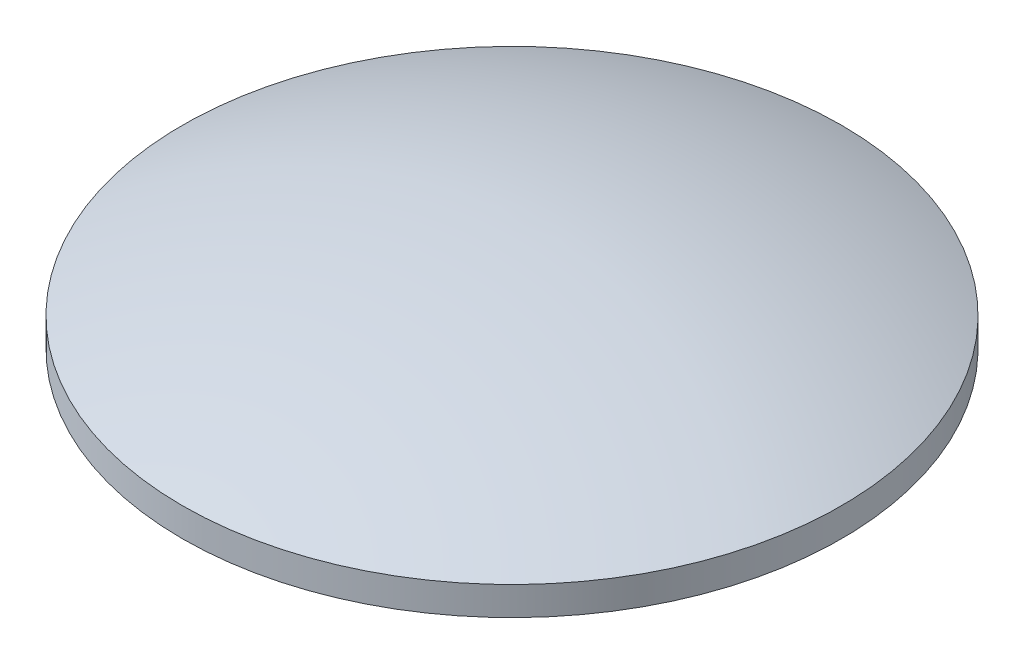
ISO-10303-21;
HEADER;
FILE_DESCRIPTION(('STEP AP214'),'2;1');
FILE_NAME('part.step','',(''),(''),'','','');
FILE_SCHEMA(('AUTOMOTIVE_DESIGN { 1 0 10303 214 1 1 1 1 }'));
ENDSEC;
DATA;
#1=APPLICATION_CONTEXT('core data for automotive mechanical design processes');
#2=APPLICATION_PROTOCOL_DEFINITION('international standard','automotive_design',2000,#1);
#3=PRODUCT_CONTEXT('',#1,'mechanical');
#4=PRODUCT('Part','Part','',(#3));
#5=PRODUCT_RELATED_PRODUCT_CATEGORY('part','',(#4));
#6=PRODUCT_DEFINITION_FORMATION('','',#4);
#7=PRODUCT_DEFINITION_CONTEXT('part definition',#1,'design');
#8=PRODUCT_DEFINITION('design','',#6,#7);
#9=PRODUCT_DEFINITION_SHAPE('','',#8);
#10=(LENGTH_UNIT() NAMED_UNIT(*) SI_UNIT(.MILLI.,.METRE.));
#11=(NAMED_UNIT(*) PLANE_ANGLE_UNIT() SI_UNIT($,.RADIAN.));
#12=(NAMED_UNIT(*) SI_UNIT($,.STERADIAN.) SOLID_ANGLE_UNIT());
#13=UNCERTAINTY_MEASURE_WITH_UNIT(LENGTH_MEASURE(1.E-05),#10,'distance_accuracy_value','');
#14=(GEOMETRIC_REPRESENTATION_CONTEXT(3) GLOBAL_UNCERTAINTY_ASSIGNED_CONTEXT((#13)) GLOBAL_UNIT_ASSIGNED_CONTEXT((#10,
#11,#12)) REPRESENTATION_CONTEXT('',''));
#15=CARTESIAN_POINT('',(0.,0.,0.));
#16=DIRECTION('',(0.,0.,1.));
#17=DIRECTION('',(1.,0.,0.));
#18=AXIS2_PLACEMENT_3D('',#15,#16,#17);
#19=CARTESIAN_POINT('',(0.,0.254,0.));
#20=DIRECTION('',(0.,-1.,0.));
#21=DIRECTION('',(0.,0.,-1.));
#22=AXIS2_PLACEMENT_3D('',#19,#20,#21);
#23=CYLINDRICAL_SURFACE('',#22,2.921);
#24=CARTESIAN_POINT('',(0.,0.254,0.));
#25=DIRECTION('',(0.,1.,0.));
#26=DIRECTION('',(0.,0.,1.));
#27=AXIS2_PLACEMENT_3D('',#24,#25,#26);
#28=CIRCLE('',#27,2.921);
#29=CARTESIAN_POINT('',(0.,0.254,2.921));
#30=VERTEX_POINT('',#29);
#31=EDGE_CURVE('E10',#30,#30,#28,.T.);
#32=ORIENTED_EDGE('',*,*,#31,.F.);
#33=EDGE_LOOP('',(#32));
#34=FACE_BOUND('',#33,.T.);
#35=CARTESIAN_POINT('',(0.,0.,0.));
#36=DIRECTION('',(0.,1.,0.));
#37=DIRECTION('',(0.,0.,1.));
#38=AXIS2_PLACEMENT_3D('',#35,#36,#37);
#39=CIRCLE('',#38,2.921);
#40=CARTESIAN_POINT('',(0.,0.,2.921));
#41=VERTEX_POINT('',#40);
#42=EDGE_CURVE('E37',#41,#41,#39,.T.);
#43=ORIENTED_EDGE('',*,*,#42,.T.);
#44=EDGE_LOOP('',(#43));
#45=FACE_BOUND('',#44,.T.);
#46=ADVANCED_FACE('F30',(#34,#45),#23,.T.);
#47=CARTESIAN_POINT('',(0.,-6.1468,0.));
#48=DIRECTION('',(0.,0.,1.));
#49=DIRECTION('',(1.,0.,0.));
#50=AXIS2_PLACEMENT_3D('',#47,#48,#49);
#51=SPHERICAL_SURFACE('',#50,7.0358);
#52=CARTESIAN_POINT('',(0.,-6.1468,0.));
#53=DIRECTION('',(0.,1.,0.));
#54=DIRECTION('',(0.,0.,1.));
#55=AXIS2_PLACEMENT_3D('',#52,#53,#54);
#56=SPHERICAL_SURFACE('',#55,7.0358);
#57=ORIENTED_EDGE('',*,*,#31,.T.);
#58=EDGE_LOOP('',(#57));
#59=FACE_BOUND('',#58,.T.);
#60=ADVANCED_FACE('F32',(#59),#56,.T.);
#61=CARTESIAN_POINT('',(0.,0.,0.));
#62=DIRECTION('',(0.,1.,0.));
#63=DIRECTION('',(0.,0.,1.));
#64=AXIS2_PLACEMENT_3D('',#61,#62,#63);
#65=PLANE('',#64);
#66=ORIENTED_EDGE('',*,*,#42,.F.);
#67=EDGE_LOOP('',(#66));
#68=FACE_BOUND('',#67,.T.);
#69=ADVANCED_FACE('F44',(#68),#65,.F.);
#70=CLOSED_SHELL('',(#46,#60,#69));
#71=MANIFOLD_SOLID_BREP('B2',#70);
#72=ADVANCED_BREP_SHAPE_REPRESENTATION('',(#18,#71),#14);
#73=SHAPE_DEFINITION_REPRESENTATION(#9,#72);
ENDSEC;
END-ISO-10303-21;
